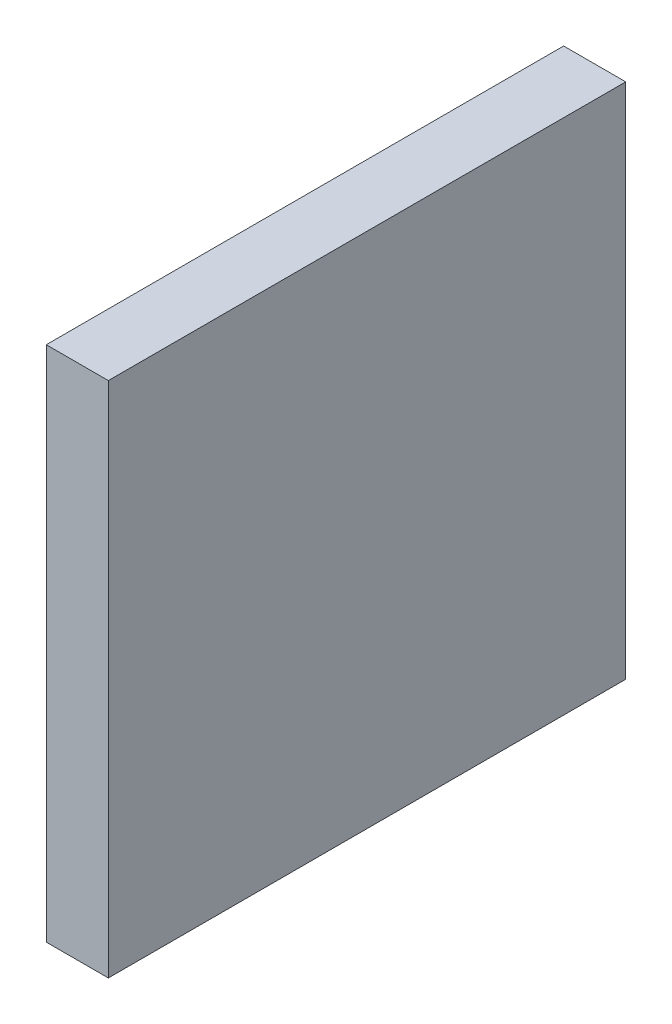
from build123d import *

# Parameters (mm, degrees)
SKETCH1_W      = 50
SKETCH1_H      = 50
EXTRUDE1_DEPTH = 6


with BuildPart() as part:
    # Sketch1 → Extrude1 (new body)
    with BuildSketch(Plane(origin=(0, 0, 0), x_dir=(0, 0, -1), z_dir=(1, 0, 0))):
        with Locations((25, 25)):
            Rectangle(SKETCH1_W, SKETCH1_H)
    extrude(amount=EXTRUDE1_DEPTH)


solid = part.part
